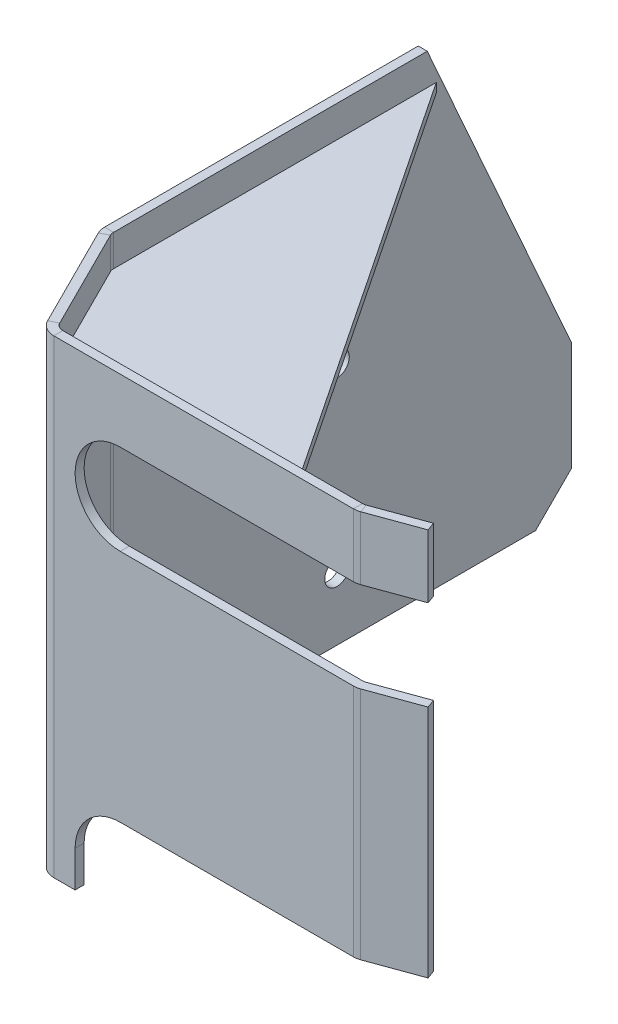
ISO-10303-21;
HEADER;
FILE_DESCRIPTION(('STEP AP214'),'2;1');
FILE_NAME('part.step','',(''),(''),'','','');
FILE_SCHEMA(('AUTOMOTIVE_DESIGN { 1 0 10303 214 1 1 1 1 }'));
ENDSEC;
DATA;
#1=APPLICATION_CONTEXT('core data for automotive mechanical design processes');
#2=APPLICATION_PROTOCOL_DEFINITION('international standard','automotive_design',2000,#1);
#3=PRODUCT_CONTEXT('',#1,'mechanical');
#4=PRODUCT('Part','Part','',(#3));
#5=PRODUCT_RELATED_PRODUCT_CATEGORY('part','',(#4));
#6=PRODUCT_DEFINITION_FORMATION('','',#4);
#7=PRODUCT_DEFINITION_CONTEXT('part definition',#1,'design');
#8=PRODUCT_DEFINITION('design','',#6,#7);
#9=PRODUCT_DEFINITION_SHAPE('','',#8);
#10=(LENGTH_UNIT() NAMED_UNIT(*) SI_UNIT(.MILLI.,.METRE.));
#11=(NAMED_UNIT(*) PLANE_ANGLE_UNIT() SI_UNIT($,.RADIAN.));
#12=(NAMED_UNIT(*) SI_UNIT($,.STERADIAN.) SOLID_ANGLE_UNIT());
#13=UNCERTAINTY_MEASURE_WITH_UNIT(LENGTH_MEASURE(1.E-05),#10,'distance_accuracy_value','');
#14=(GEOMETRIC_REPRESENTATION_CONTEXT(3) GLOBAL_UNCERTAINTY_ASSIGNED_CONTEXT((#13)) GLOBAL_UNIT_ASSIGNED_CONTEXT((#10,
#11,#12)) REPRESENTATION_CONTEXT('',''));
#15=CARTESIAN_POINT('',(0.,0.,0.));
#16=DIRECTION('',(0.,0.,1.));
#17=DIRECTION('',(1.,0.,0.));
#18=AXIS2_PLACEMENT_3D('',#15,#16,#17);
#19=CARTESIAN_POINT('',(15.,130.,157.5));
#20=DIRECTION('',(0.,0.,-1.));
#21=DIRECTION('',(-1.,0.,0.));
#22=AXIS2_PLACEMENT_3D('',#19,#20,#21);
#23=PLANE('',#22);
#24=CARTESIAN_POINT('',(34.9504396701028,10.,157.5));
#25=DIRECTION('',(0.,0.,-1.));
#26=DIRECTION('',(-1.,0.,0.));
#27=AXIS2_PLACEMENT_3D('',#24,#25,#26);
#28=CIRCLE('',#27,12.5);
#29=CARTESIAN_POINT('',(22.4504396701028,10.,157.5));
#30=VERTEX_POINT('',#29);
#31=CARTESIAN_POINT('',(34.9504396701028,22.5,157.5));
#32=VERTEX_POINT('',#31);
#33=EDGE_CURVE('E288',#30,#32,#28,.T.);
#34=ORIENTED_EDGE('',*,*,#33,.F.);
#35=DIRECTION('',(0.,-1.,0.));
#36=VECTOR('',#35,1.);
#37=CARTESIAN_POINT('',(22.4504396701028,10.,157.5));
#38=LINE('',#37,#36);
#39=CARTESIAN_POINT('',(22.4504396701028,0.,157.5));
#40=VERTEX_POINT('',#39);
#41=EDGE_CURVE('E270',#30,#40,#38,.T.);
#42=ORIENTED_EDGE('',*,*,#41,.T.);
#43=DIRECTION('',(1.,0.,0.));
#44=VECTOR('',#43,1.);
#45=CARTESIAN_POINT('',(15.,0.,157.5));
#46=LINE('',#45,#44);
#47=CARTESIAN_POINT('',(16.5450849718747,0.,157.5));
#48=VERTEX_POINT('',#47);
#49=EDGE_CURVE('E285',#48,#40,#46,.T.);
#50=ORIENTED_EDGE('',*,*,#49,.F.);
#51=DIRECTION('',(0.,-1.,0.));
#52=VECTOR('',#51,1.);
#53=CARTESIAN_POINT('',(16.5450849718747,130.,157.5));
#54=LINE('',#53,#52);
#55=CARTESIAN_POINT('',(16.5450849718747,118.75,157.5));
#56=VERTEX_POINT('',#55);
#57=EDGE_CURVE('E440',#56,#48,#54,.T.);
#58=ORIENTED_EDGE('',*,*,#57,.F.);
#59=DIRECTION('',(1.,0.,0.));
#60=VECTOR('',#59,1.);
#61=CARTESIAN_POINT('',(15.,118.75,157.5));
#62=LINE('',#61,#60);
#63=CARTESIAN_POINT('',(80.,118.75,157.5));
#64=VERTEX_POINT('',#63);
#65=EDGE_CURVE('E630',#56,#64,#62,.T.);
#66=ORIENTED_EDGE('',*,*,#65,.T.);
#67=DIRECTION('',(0.,-1.,0.));
#68=VECTOR('',#67,1.);
#69=CARTESIAN_POINT('',(80.,130.,157.5));
#70=LINE('',#69,#68);
#71=CARTESIAN_POINT('',(80.,121.25,157.5));
#72=VERTEX_POINT('',#71);
#73=EDGE_CURVE('E523',#72,#64,#70,.T.);
#74=ORIENTED_EDGE('',*,*,#73,.F.);
#75=DIRECTION('',(1.,0.,0.));
#76=VECTOR('',#75,1.);
#77=CARTESIAN_POINT('',(15.,121.25,157.5));
#78=LINE('',#77,#76);
#79=CARTESIAN_POINT('',(16.5450849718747,121.25,157.5));
#80=VERTEX_POINT('',#79);
#81=EDGE_CURVE('E524',#80,#72,#78,.T.);
#82=ORIENTED_EDGE('',*,*,#81,.F.);
#83=CARTESIAN_POINT('',(16.5450849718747,130.,157.5));
#84=VERTEX_POINT('',#83);
#85=EDGE_CURVE('E441',#84,#80,#54,.T.);
#86=ORIENTED_EDGE('',*,*,#85,.F.);
#87=DIRECTION('',(1.,0.,0.));
#88=VECTOR('',#87,1.);
#89=CARTESIAN_POINT('',(15.,130.,157.5));
#90=LINE('',#89,#88);
#91=CARTESIAN_POINT('',(99.5591825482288,130.,157.5));
#92=VERTEX_POINT('',#91);
#93=EDGE_CURVE('E355',#84,#92,#90,.T.);
#94=ORIENTED_EDGE('',*,*,#93,.T.);
#95=DIRECTION('',(0.,-1.,0.));
#96=VECTOR('',#95,1.);
#97=CARTESIAN_POINT('',(99.5591825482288,130.,157.5));
#98=LINE('',#97,#96);
#99=CARTESIAN_POINT('',(99.5591825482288,112.5,157.5));
#100=VERTEX_POINT('',#99);
#101=EDGE_CURVE('E445',#92,#100,#98,.T.);
#102=ORIENTED_EDGE('',*,*,#101,.T.);
#103=DIRECTION('',(1.,0.,0.));
#104=VECTOR('',#103,1.);
#105=CARTESIAN_POINT('',(114.950439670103,112.5,157.5));
#106=LINE('',#105,#104);
#107=CARTESIAN_POINT('',(34.9504396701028,112.5,157.5));
#108=VERTEX_POINT('',#107);
#109=EDGE_CURVE('E298',#108,#100,#106,.T.);
#110=ORIENTED_EDGE('',*,*,#109,.F.);
#111=CARTESIAN_POINT('',(34.9504396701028,100.,157.5));
#112=DIRECTION('',(0.,0.,-1.));
#113=DIRECTION('',(-1.,0.,0.));
#114=AXIS2_PLACEMENT_3D('',#111,#112,#113);
#115=CIRCLE('',#114,12.5);
#116=CARTESIAN_POINT('',(34.9504396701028,87.5,157.5));
#117=VERTEX_POINT('',#116);
#118=EDGE_CURVE('E646',#117,#108,#115,.T.);
#119=ORIENTED_EDGE('',*,*,#118,.F.);
#120=DIRECTION('',(-1.,0.,0.));
#121=VECTOR('',#120,1.);
#122=CARTESIAN_POINT('',(114.950439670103,87.5,157.5));
#123=LINE('',#122,#121);
#124=CARTESIAN_POINT('',(99.5591825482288,87.5,157.5));
#125=VERTEX_POINT('',#124);
#126=EDGE_CURVE('E649',#125,#117,#123,.T.);
#127=ORIENTED_EDGE('',*,*,#126,.F.);
#128=CARTESIAN_POINT('',(99.5591825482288,22.5,157.5));
#129=VERTEX_POINT('',#128);
#130=EDGE_CURVE('E444',#125,#129,#98,.T.);
#131=ORIENTED_EDGE('',*,*,#130,.T.);
#132=DIRECTION('',(1.,0.,0.));
#133=VECTOR('',#132,1.);
#134=CARTESIAN_POINT('',(114.950439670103,22.5,157.5));
#135=LINE('',#134,#133);
#136=EDGE_CURVE('E538',#32,#129,#135,.T.);
#137=ORIENTED_EDGE('',*,*,#136,.F.);
#138=EDGE_LOOP('',(#34,#42,#50,#58,#66,#74,#82,#86,#94,#102,#110,#119,#127,#131,#137));
#139=FACE_BOUND('',#138,.T.);
#140=ADVANCED_FACE('F42',(#139),#23,.T.);
#141=CARTESIAN_POINT('',(15.,130.,160.));
#142=DIRECTION('',(0.,0.,-1.));
#143=DIRECTION('',(-1.,0.,0.));
#144=AXIS2_PLACEMENT_3D('',#141,#142,#143);
#145=PLANE('',#144);
#146=DIRECTION('',(0.,1.,0.));
#147=VECTOR('',#146,1.);
#148=CARTESIAN_POINT('',(22.4504396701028,130.,160.));
#149=LINE('',#148,#147);
#150=CARTESIAN_POINT('',(22.4504396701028,10.,160.));
#151=VERTEX_POINT('',#150);
#152=CARTESIAN_POINT('',(22.4504396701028,0.,160.));
#153=VERTEX_POINT('',#152);
#154=EDGE_CURVE('E273',#151,#153,#149,.F.);
#155=ORIENTED_EDGE('',*,*,#154,.F.);
#156=CARTESIAN_POINT('',(34.9504396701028,10.,160.));
#157=DIRECTION('',(0.,0.,-1.));
#158=DIRECTION('',(-1.,0.,0.));
#159=AXIS2_PLACEMENT_3D('',#156,#157,#158);
#160=CIRCLE('',#159,12.5);
#161=CARTESIAN_POINT('',(34.9504396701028,22.5,160.));
#162=VERTEX_POINT('',#161);
#163=EDGE_CURVE('E537',#151,#162,#160,.T.);
#164=ORIENTED_EDGE('',*,*,#163,.T.);
#165=DIRECTION('',(1.,0.,0.));
#166=VECTOR('',#165,1.);
#167=CARTESIAN_POINT('',(114.950439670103,22.5,160.));
#168=LINE('',#167,#166);
#169=CARTESIAN_POINT('',(99.5591825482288,22.5,160.));
#170=VERTEX_POINT('',#169);
#171=EDGE_CURVE('E567',#162,#170,#168,.T.);
#172=ORIENTED_EDGE('',*,*,#171,.T.);
#173=DIRECTION('',(0.,-1.,0.));
#174=VECTOR('',#173,1.);
#175=CARTESIAN_POINT('',(99.5591825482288,130.,160.));
#176=LINE('',#175,#174);
#177=CARTESIAN_POINT('',(99.5591825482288,87.5,160.));
#178=VERTEX_POINT('',#177);
#179=EDGE_CURVE('E402',#178,#170,#176,.T.);
#180=ORIENTED_EDGE('',*,*,#179,.F.);
#181=DIRECTION('',(-1.,0.,0.));
#182=VECTOR('',#181,1.);
#183=CARTESIAN_POINT('',(114.950439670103,87.5,160.));
#184=LINE('',#183,#182);
#185=CARTESIAN_POINT('',(34.9504396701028,87.5,160.));
#186=VERTEX_POINT('',#185);
#187=EDGE_CURVE('E665',#178,#186,#184,.T.);
#188=ORIENTED_EDGE('',*,*,#187,.T.);
#189=CARTESIAN_POINT('',(34.9504396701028,100.,160.));
#190=DIRECTION('',(0.,0.,-1.));
#191=DIRECTION('',(-1.,0.,0.));
#192=AXIS2_PLACEMENT_3D('',#189,#190,#191);
#193=CIRCLE('',#192,12.5);
#194=CARTESIAN_POINT('',(34.9504396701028,112.5,160.));
#195=VERTEX_POINT('',#194);
#196=EDGE_CURVE('E535',#186,#195,#193,.T.);
#197=ORIENTED_EDGE('',*,*,#196,.T.);
#198=DIRECTION('',(1.,0.,0.));
#199=VECTOR('',#198,1.);
#200=CARTESIAN_POINT('',(114.950439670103,112.5,160.));
#201=LINE('',#200,#199);
#202=CARTESIAN_POINT('',(99.5591825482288,112.5,160.));
#203=VERTEX_POINT('',#202);
#204=EDGE_CURVE('E532',#195,#203,#201,.T.);
#205=ORIENTED_EDGE('',*,*,#204,.T.);
#206=CARTESIAN_POINT('',(99.5591825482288,130.,160.));
#207=VERTEX_POINT('',#206);
#208=EDGE_CURVE('E403',#207,#203,#176,.T.);
#209=ORIENTED_EDGE('',*,*,#208,.F.);
#210=DIRECTION('',(1.,0.,0.));
#211=VECTOR('',#210,1.);
#212=CARTESIAN_POINT('',(15.,130.,160.));
#213=LINE('',#212,#211);
#214=CARTESIAN_POINT('',(16.5450849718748,130.,160.));
#215=VERTEX_POINT('',#214);
#216=EDGE_CURVE('E389',#215,#207,#213,.T.);
#217=ORIENTED_EDGE('',*,*,#216,.F.);
#218=DIRECTION('',(0.,-1.,0.));
#219=VECTOR('',#218,1.);
#220=CARTESIAN_POINT('',(16.5450849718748,130.,160.));
#221=LINE('',#220,#219);
#222=CARTESIAN_POINT('',(16.5450849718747,0.,160.));
#223=VERTEX_POINT('',#222);
#224=EDGE_CURVE('E407',#215,#223,#221,.T.);
#225=ORIENTED_EDGE('',*,*,#224,.T.);
#226=DIRECTION('',(1.,0.,0.));
#227=VECTOR('',#226,1.);
#228=CARTESIAN_POINT('',(15.,0.,160.));
#229=LINE('',#228,#227);
#230=EDGE_CURVE('E337',#223,#153,#229,.T.);
#231=ORIENTED_EDGE('',*,*,#230,.T.);
#232=EDGE_LOOP('',(#155,#164,#172,#180,#188,#197,#205,#209,#217,#225,#231));
#233=FACE_BOUND('',#232,.T.);
#234=ADVANCED_FACE('F752',(#233),#145,.F.);
#235=CARTESIAN_POINT('',(101.269283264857,0.,159.69846310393));
#236=DIRECTION('',(0.,-1.,0.));
#237=DIRECTION('',(0.,0.,-1.));
#238=AXIS2_PLACEMENT_3D('',#235,#236,#237);
#239=PLANE('',#238);
#240=ORIENTED_EDGE('',*,*,#49,.T.);
#241=DIRECTION('',(0.,0.,-1.));
#242=VECTOR('',#241,1.);
#243=CARTESIAN_POINT('',(22.4504396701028,0.,157.5));
#244=LINE('',#243,#242);
#245=EDGE_CURVE('E267',#40,#153,#244,.F.);
#246=ORIENTED_EDGE('',*,*,#245,.T.);
#247=ORIENTED_EDGE('',*,*,#230,.F.);
#248=DIRECTION('',(0.,0.,-1.));
#249=VECTOR('',#248,1.);
#250=CARTESIAN_POINT('',(16.5450849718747,0.,160.));
#251=LINE('',#250,#249);
#252=EDGE_CURVE('E295',#223,#48,#251,.T.);
#253=ORIENTED_EDGE('',*,*,#252,.T.);
#254=EDGE_LOOP('',(#240,#246,#247,#253));
#255=FACE_BOUND('',#254,.T.);
#256=ADVANCED_FACE('F293',(#255),#239,.T.);
#257=CARTESIAN_POINT('',(100.855050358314,130.,159.849231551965));
#258=DIRECTION('',(-0.34202014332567,0.,-0.939692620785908));
#259=DIRECTION('',(-0.939692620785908,0.,0.34202014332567));
#260=AXIS2_PLACEMENT_3D('',#257,#258,#259);
#261=PLANE('',#260);
#262=DIRECTION('',(0.939692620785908,0.,-0.34202014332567));
#263=VECTOR('',#262,1.);
#264=CARTESIAN_POINT('',(164.676466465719,22.5,136.620135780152));
#265=LINE('',#264,#263);
#266=CARTESIAN_POINT('',(101.269283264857,22.5,159.69846310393));
#267=VERTEX_POINT('',#266);
#268=CARTESIAN_POINT('',(114.950439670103,22.5,154.71892940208));
#269=VERTEX_POINT('',#268);
#270=EDGE_CURVE('E601',#267,#269,#265,.T.);
#271=ORIENTED_EDGE('',*,*,#270,.T.);
#272=DIRECTION('',(0.,-1.,0.));
#273=VECTOR('',#272,1.);
#274=CARTESIAN_POINT('',(114.950439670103,130.,154.71892940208));
#275=LINE('',#274,#273);
#276=CARTESIAN_POINT('',(114.950439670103,87.5,154.71892940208));
#277=VERTEX_POINT('',#276);
#278=EDGE_CURVE('E459',#277,#269,#275,.T.);
#279=ORIENTED_EDGE('',*,*,#278,.F.);
#280=DIRECTION('',(-0.939692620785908,0.,0.34202014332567));
#281=VECTOR('',#280,1.);
#282=CARTESIAN_POINT('',(164.676466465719,87.5,136.620135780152));
#283=LINE('',#282,#281);
#284=CARTESIAN_POINT('',(101.269283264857,87.5,159.69846310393));
#285=VERTEX_POINT('',#284);
#286=EDGE_CURVE('E661',#277,#285,#283,.T.);
#287=ORIENTED_EDGE('',*,*,#286,.T.);
#288=DIRECTION('',(0.,-1.,0.));
#289=VECTOR('',#288,1.);
#290=CARTESIAN_POINT('',(101.269283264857,130.,159.69846310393));
#291=LINE('',#290,#289);
#292=EDGE_CURVE('E397',#285,#267,#291,.T.);
#293=ORIENTED_EDGE('',*,*,#292,.T.);
#294=EDGE_LOOP('',(#271,#279,#287,#293));
#295=FACE_BOUND('',#294,.T.);
#296=ADVANCED_FACE('F782',(#295),#261,.F.);
#297=CARTESIAN_POINT('',(114.095389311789,130.,152.369697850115));
#298=DIRECTION('',(0.939692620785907,0.,-0.342020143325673));
#299=DIRECTION('',(-0.342020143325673,0.,-0.939692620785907));
#300=AXIS2_PLACEMENT_3D('',#297,#298,#299);
#301=PLANE('',#300);
#302=ORIENTED_EDGE('',*,*,#278,.T.);
#303=DIRECTION('',(0.342020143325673,0.,0.939692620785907));
#304=VECTOR('',#303,1.);
#305=CARTESIAN_POINT('',(65.2244128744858,22.5,18.0977936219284));
#306=LINE('',#305,#304);
#307=CARTESIAN_POINT('',(114.095389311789,22.5,152.369697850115));
#308=VERTEX_POINT('',#307);
#309=EDGE_CURVE('E598',#308,#269,#306,.T.);
#310=ORIENTED_EDGE('',*,*,#309,.F.);
#311=DIRECTION('',(0.,-1.,0.));
#312=VECTOR('',#311,1.);
#313=CARTESIAN_POINT('',(114.095389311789,130.,152.369697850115));
#314=LINE('',#313,#312);
#315=CARTESIAN_POINT('',(114.095389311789,87.5,152.369697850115));
#316=VERTEX_POINT('',#315);
#317=EDGE_CURVE('E454',#316,#308,#314,.T.);
#318=ORIENTED_EDGE('',*,*,#317,.F.);
#319=DIRECTION('',(-0.342020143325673,0.,-0.939692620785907));
#320=VECTOR('',#319,1.);
#321=CARTESIAN_POINT('',(65.2244128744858,87.5,18.0977936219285));
#322=LINE('',#321,#320);
#323=EDGE_CURVE('E658',#277,#316,#322,.T.);
#324=ORIENTED_EDGE('',*,*,#323,.F.);
#325=EDGE_LOOP('',(#302,#310,#318,#324));
#326=FACE_BOUND('',#325,.T.);
#327=ADVANCED_FACE('F861',(#326),#301,.T.);
#328=CARTESIAN_POINT('',(100.,130.,157.5));
#329=DIRECTION('',(-0.34202014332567,0.,-0.939692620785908));
#330=DIRECTION('',(-0.939692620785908,0.,0.34202014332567));
#331=AXIS2_PLACEMENT_3D('',#328,#329,#330);
#332=PLANE('',#331);
#333=ORIENTED_EDGE('',*,*,#317,.T.);
#334=DIRECTION('',(0.939692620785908,0.,-0.34202014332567));
#335=VECTOR('',#334,1.);
#336=CARTESIAN_POINT('',(163.821416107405,22.5,134.270904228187));
#337=LINE('',#336,#335);
#338=CARTESIAN_POINT('',(100.414232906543,22.5,157.349231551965));
#339=VERTEX_POINT('',#338);
#340=EDGE_CURVE('E555',#339,#308,#337,.T.);
#341=ORIENTED_EDGE('',*,*,#340,.F.);
#342=DIRECTION('',(0.,-1.,0.));
#343=VECTOR('',#342,1.);
#344=CARTESIAN_POINT('',(100.414232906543,130.,157.349231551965));
#345=LINE('',#344,#343);
#346=CARTESIAN_POINT('',(100.414232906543,87.5,157.349231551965));
#347=VERTEX_POINT('',#346);
#348=EDGE_CURVE('E449',#347,#339,#345,.T.);
#349=ORIENTED_EDGE('',*,*,#348,.F.);
#350=DIRECTION('',(-0.939692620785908,0.,0.34202014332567));
#351=VECTOR('',#350,1.);
#352=CARTESIAN_POINT('',(163.821416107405,87.5,134.270904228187));
#353=LINE('',#352,#351);
#354=EDGE_CURVE('E655',#316,#347,#353,.T.);
#355=ORIENTED_EDGE('',*,*,#354,.F.);
#356=EDGE_LOOP('',(#333,#341,#349,#355));
#357=FACE_BOUND('',#356,.T.);
#358=ADVANCED_FACE('F797',(#357),#332,.T.);
#359=CARTESIAN_POINT('',(99.5591825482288,130.,155.));
#360=DIRECTION('',(0.,-1.,0.));
#361=DIRECTION('',(0.,0.,-1.));
#362=AXIS2_PLACEMENT_3D('',#359,#360,#361);
#363=CYLINDRICAL_SURFACE('',#362,2.5);
#364=ORIENTED_EDGE('',*,*,#348,.T.);
#365=CARTESIAN_POINT('',(99.5591825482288,22.5,155.));
#366=DIRECTION('',(0.,-1.,0.));
#367=DIRECTION('',(0.,0.,-1.));
#368=AXIS2_PLACEMENT_3D('',#365,#366,#367);
#369=CIRCLE('',#368,2.5);
#370=EDGE_CURVE('E553',#129,#339,#369,.F.);
#371=ORIENTED_EDGE('',*,*,#370,.F.);
#372=ORIENTED_EDGE('',*,*,#130,.F.);
#373=CARTESIAN_POINT('',(99.5591825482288,87.5,155.));
#374=DIRECTION('',(0.,1.,0.));
#375=DIRECTION('',(0.,0.,1.));
#376=AXIS2_PLACEMENT_3D('',#373,#374,#375);
#377=CIRCLE('',#376,2.5);
#378=EDGE_CURVE('E652',#347,#125,#377,.F.);
#379=ORIENTED_EDGE('',*,*,#378,.F.);
#380=EDGE_LOOP('',(#364,#371,#372,#379));
#381=FACE_BOUND('',#380,.T.);
#382=ADVANCED_FACE('F775',(#381),#363,.F.);
#383=CARTESIAN_POINT('',(99.5591825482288,130.,155.));
#384=DIRECTION('',(0.,-1.,0.));
#385=DIRECTION('',(0.,0.,-1.));
#386=AXIS2_PLACEMENT_3D('',#383,#384,#385);
#387=CYLINDRICAL_SURFACE('',#386,5.);
#388=CARTESIAN_POINT('',(99.5591825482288,22.5,155.));
#389=DIRECTION('',(0.,-1.,0.));
#390=DIRECTION('',(0.,0.,-1.));
#391=AXIS2_PLACEMENT_3D('',#388,#389,#390);
#392=CIRCLE('',#391,5.);
#393=EDGE_CURVE('E570',#170,#267,#392,.F.);
#394=ORIENTED_EDGE('',*,*,#393,.T.);
#395=ORIENTED_EDGE('',*,*,#292,.F.);
#396=CARTESIAN_POINT('',(99.5591825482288,87.5,155.));
#397=DIRECTION('',(0.,1.,0.));
#398=DIRECTION('',(0.,0.,1.));
#399=AXIS2_PLACEMENT_3D('',#396,#397,#398);
#400=CIRCLE('',#399,5.);
#401=EDGE_CURVE('E529',#285,#178,#400,.F.);
#402=ORIENTED_EDGE('',*,*,#401,.T.);
#403=ORIENTED_EDGE('',*,*,#179,.T.);
#404=EDGE_LOOP('',(#394,#395,#402,#403));
#405=FACE_BOUND('',#404,.T.);
#406=ADVANCED_FACE('F785',(#405),#387,.T.);
#407=CARTESIAN_POINT('',(16.5450849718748,130.,155.));
#408=DIRECTION('',(0.,-1.,0.));
#409=DIRECTION('',(0.,0.,-1.));
#410=AXIS2_PLACEMENT_3D('',#407,#408,#409);
#411=CYLINDRICAL_SURFACE('',#410,2.5);
#412=DIRECTION('',(0.,-1.,0.));
#413=VECTOR('',#412,1.);
#414=CARTESIAN_POINT('',(14.309016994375,130.,156.11803398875));
#415=LINE('',#414,#413);
#416=CARTESIAN_POINT('',(14.309016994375,118.75,156.11803398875));
#417=VERTEX_POINT('',#416);
#418=CARTESIAN_POINT('',(14.309016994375,0.,156.11803398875));
#419=VERTEX_POINT('',#418);
#420=EDGE_CURVE('E435',#417,#419,#415,.T.);
#421=ORIENTED_EDGE('',*,*,#420,.F.);
#422=CARTESIAN_POINT('',(16.5450849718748,118.75,155.));
#423=DIRECTION('',(0.,1.,0.));
#424=DIRECTION('',(0.,0.,1.));
#425=AXIS2_PLACEMENT_3D('',#422,#423,#424);
#426=CIRCLE('',#425,2.5);
#427=EDGE_CURVE('E626',#417,#56,#426,.T.);
#428=ORIENTED_EDGE('',*,*,#427,.T.);
#429=ORIENTED_EDGE('',*,*,#57,.T.);
#430=CARTESIAN_POINT('',(16.5450849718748,0.,155.));
#431=DIRECTION('',(0.,-1.,0.));
#432=DIRECTION('',(0.,0.,-1.));
#433=AXIS2_PLACEMENT_3D('',#430,#431,#432);
#434=CIRCLE('',#433,2.5);
#435=EDGE_CURVE('E297',#419,#48,#434,.F.);
#436=ORIENTED_EDGE('',*,*,#435,.F.);
#437=EDGE_LOOP('',(#421,#428,#429,#436));
#438=FACE_BOUND('',#437,.T.);
#439=ADVANCED_FACE('F836',(#438),#411,.F.);
#440=CARTESIAN_POINT('',(15.,130.,157.5));
#441=DIRECTION('',(0.894427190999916,0.,-0.447213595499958));
#442=DIRECTION('',(-0.447213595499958,0.,-0.894427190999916));
#443=AXIS2_PLACEMENT_3D('',#440,#441,#442);
#444=PLANE('',#443);
#445=DIRECTION('',(0.,-1.,0.));
#446=VECTOR('',#445,1.);
#447=CARTESIAN_POINT('',(0.263932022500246,130.,128.027864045));
#448=LINE('',#447,#446);
#449=CARTESIAN_POINT('',(0.263932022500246,118.75,128.027864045));
#450=VERTEX_POINT('',#449);
#451=CARTESIAN_POINT('',(0.263932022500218,0.,128.027864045));
#452=VERTEX_POINT('',#451);
#453=EDGE_CURVE('E430',#450,#452,#448,.T.);
#454=ORIENTED_EDGE('',*,*,#453,.F.);
#455=DIRECTION('',(0.447213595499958,0.,0.894427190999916));
#456=VECTOR('',#455,1.);
#457=CARTESIAN_POINT('',(15.,118.75,157.5));
#458=LINE('',#457,#456);
#459=EDGE_CURVE('E622',#450,#417,#458,.T.);
#460=ORIENTED_EDGE('',*,*,#459,.T.);
#461=ORIENTED_EDGE('',*,*,#420,.T.);
#462=DIRECTION('',(0.447213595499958,0.,0.894427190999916));
#463=VECTOR('',#462,1.);
#464=CARTESIAN_POINT('',(15.,0.,157.5));
#465=LINE('',#464,#463);
#466=EDGE_CURVE('E303',#452,#419,#465,.T.);
#467=ORIENTED_EDGE('',*,*,#466,.F.);
#468=EDGE_LOOP('',(#454,#460,#461,#467));
#469=FACE_BOUND('',#468,.T.);
#470=ADVANCED_FACE('F814',(#469),#444,.T.);
#471=CARTESIAN_POINT('',(2.50000000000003,130.,126.909830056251));
#472=DIRECTION('',(0.,-1.,0.));
#473=DIRECTION('',(0.,0.,-1.));
#474=AXIS2_PLACEMENT_3D('',#471,#472,#473);
#475=CYLINDRICAL_SURFACE('',#474,2.5);
#476=DIRECTION('',(0.,-1.,0.));
#477=VECTOR('',#476,1.);
#478=CARTESIAN_POINT('',(0.,130.,126.90983005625));
#479=LINE('',#478,#477);
#480=CARTESIAN_POINT('',(0.,118.75,126.90983005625));
#481=VERTEX_POINT('',#480);
#482=CARTESIAN_POINT('',(0.,0.,126.909830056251));
#483=VERTEX_POINT('',#482);
#484=EDGE_CURVE('E425',#481,#483,#479,.T.);
#485=ORIENTED_EDGE('',*,*,#484,.F.);
#486=CARTESIAN_POINT('',(2.5,118.75,126.909830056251));
#487=DIRECTION('',(0.,1.,0.));
#488=DIRECTION('',(0.,0.,1.));
#489=AXIS2_PLACEMENT_3D('',#486,#487,#488);
#490=CIRCLE('',#489,2.5);
#491=EDGE_CURVE('E618',#481,#450,#490,.T.);
#492=ORIENTED_EDGE('',*,*,#491,.T.);
#493=ORIENTED_EDGE('',*,*,#453,.T.);
#494=CARTESIAN_POINT('',(2.5,0.,126.909830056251));
#495=DIRECTION('',(0.,-1.,0.));
#496=DIRECTION('',(0.,0.,-1.));
#497=AXIS2_PLACEMENT_3D('',#494,#495,#496);
#498=CIRCLE('',#497,2.5);
#499=EDGE_CURVE('E313',#483,#452,#498,.F.);
#500=ORIENTED_EDGE('',*,*,#499,.F.);
#501=EDGE_LOOP('',(#485,#492,#493,#500));
#502=FACE_BOUND('',#501,.T.);
#503=ADVANCED_FACE('F808',(#502),#475,.F.);
#504=DIRECTION('',(0.939692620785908,0.,-0.34202014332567));
#505=VECTOR('',#504,1.);
#506=CARTESIAN_POINT('',(164.676466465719,112.5,136.620135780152));
#507=LINE('',#506,#505);
#508=CARTESIAN_POINT('',(101.269283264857,112.5,159.69846310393));
#509=VERTEX_POINT('',#508);
#510=CARTESIAN_POINT('',(114.950439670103,112.5,154.71892940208));
#511=VERTEX_POINT('',#510);
#512=EDGE_CURVE('E676',#509,#511,#507,.T.);
#513=ORIENTED_EDGE('',*,*,#512,.T.);
#514=CARTESIAN_POINT('',(114.950439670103,130.,154.71892940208));
#515=VERTEX_POINT('',#514);
#516=EDGE_CURVE('E460',#515,#511,#275,.T.);
#517=ORIENTED_EDGE('',*,*,#516,.F.);
#518=DIRECTION('',(0.939692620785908,0.,-0.34202014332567));
#519=VECTOR('',#518,1.);
#520=CARTESIAN_POINT('',(100.855050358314,130.,159.849231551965));
#521=LINE('',#520,#519);
#522=CARTESIAN_POINT('',(101.269283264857,130.,159.69846310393));
#523=VERTEX_POINT('',#522);
#524=EDGE_CURVE('E340',#523,#515,#521,.T.);
#525=ORIENTED_EDGE('',*,*,#524,.F.);
#526=EDGE_CURVE('E398',#523,#509,#291,.T.);
#527=ORIENTED_EDGE('',*,*,#526,.T.);
#528=EDGE_LOOP('',(#513,#517,#525,#527));
#529=FACE_BOUND('',#528,.T.);
#530=ADVANCED_FACE('F760',(#529),#261,.F.);
#531=ORIENTED_EDGE('',*,*,#516,.T.);
#532=DIRECTION('',(0.342020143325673,0.,0.939692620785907));
#533=VECTOR('',#532,1.);
#534=CARTESIAN_POINT('',(65.2244128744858,112.5,18.0977936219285));
#535=LINE('',#534,#533);
#536=CARTESIAN_POINT('',(114.095389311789,112.5,152.369697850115));
#537=VERTEX_POINT('',#536);
#538=EDGE_CURVE('E680',#537,#511,#535,.T.);
#539=ORIENTED_EDGE('',*,*,#538,.F.);
#540=CARTESIAN_POINT('',(114.095389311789,130.,152.369697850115));
#541=VERTEX_POINT('',#540);
#542=EDGE_CURVE('E455',#541,#537,#314,.T.);
#543=ORIENTED_EDGE('',*,*,#542,.F.);
#544=DIRECTION('',(0.342020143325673,0.,0.939692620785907));
#545=VECTOR('',#544,1.);
#546=CARTESIAN_POINT('',(114.095389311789,130.,152.369697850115));
#547=LINE('',#546,#545);
#548=EDGE_CURVE('E343',#541,#515,#547,.T.);
#549=ORIENTED_EDGE('',*,*,#548,.T.);
#550=EDGE_LOOP('',(#531,#539,#543,#549));
#551=FACE_BOUND('',#550,.T.);
#552=ADVANCED_FACE('F692',(#551),#301,.T.);
#553=ORIENTED_EDGE('',*,*,#542,.T.);
#554=DIRECTION('',(0.939692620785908,0.,-0.34202014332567));
#555=VECTOR('',#554,1.);
#556=CARTESIAN_POINT('',(163.821416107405,112.5,134.270904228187));
#557=LINE('',#556,#555);
#558=CARTESIAN_POINT('',(100.414232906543,112.5,157.349231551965));
#559=VERTEX_POINT('',#558);
#560=EDGE_CURVE('E563',#559,#537,#557,.T.);
#561=ORIENTED_EDGE('',*,*,#560,.F.);
#562=CARTESIAN_POINT('',(100.414232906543,130.,157.349231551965));
#563=VERTEX_POINT('',#562);
#564=EDGE_CURVE('E450',#563,#559,#345,.T.);
#565=ORIENTED_EDGE('',*,*,#564,.F.);
#566=DIRECTION('',(0.939692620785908,0.,-0.34202014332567));
#567=VECTOR('',#566,1.);
#568=CARTESIAN_POINT('',(100.,130.,157.5));
#569=LINE('',#568,#567);
#570=EDGE_CURVE('E347',#563,#541,#569,.T.);
#571=ORIENTED_EDGE('',*,*,#570,.T.);
#572=EDGE_LOOP('',(#553,#561,#565,#571));
#573=FACE_BOUND('',#572,.T.);
#574=ADVANCED_FACE('F695',(#573),#332,.T.);
#575=ORIENTED_EDGE('',*,*,#564,.T.);
#576=CARTESIAN_POINT('',(99.5591825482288,112.5,155.));
#577=DIRECTION('',(0.,-1.,0.));
#578=DIRECTION('',(0.,0.,-1.));
#579=AXIS2_PLACEMENT_3D('',#576,#577,#578);
#580=CIRCLE('',#579,2.5);
#581=EDGE_CURVE('E306',#100,#559,#580,.F.);
#582=ORIENTED_EDGE('',*,*,#581,.F.);
#583=ORIENTED_EDGE('',*,*,#101,.F.);
#584=CARTESIAN_POINT('',(99.5591825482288,130.,155.));
#585=DIRECTION('',(0.,-1.,0.));
#586=DIRECTION('',(0.,0.,-1.));
#587=AXIS2_PLACEMENT_3D('',#584,#585,#586);
#588=CIRCLE('',#587,2.5);
#589=EDGE_CURVE('E351',#92,#563,#588,.F.);
#590=ORIENTED_EDGE('',*,*,#589,.T.);
#591=EDGE_LOOP('',(#575,#582,#583,#590));
#592=FACE_BOUND('',#591,.T.);
#593=ADVANCED_FACE('F702',(#592),#363,.F.);
#594=CARTESIAN_POINT('',(99.5591825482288,112.5,155.));
#595=DIRECTION('',(0.,-1.,0.));
#596=DIRECTION('',(0.,0.,-1.));
#597=AXIS2_PLACEMENT_3D('',#594,#595,#596);
#598=CIRCLE('',#597,5.);
#599=EDGE_CURVE('E527',#203,#509,#598,.F.);
#600=ORIENTED_EDGE('',*,*,#599,.T.);
#601=ORIENTED_EDGE('',*,*,#526,.F.);
#602=CARTESIAN_POINT('',(99.5591825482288,130.,155.));
#603=DIRECTION('',(0.,1.,0.));
#604=DIRECTION('',(1.,0.,0.));
#605=AXIS2_PLACEMENT_3D('',#602,#603,#604);
#606=CIRCLE('',#605,5.);
#607=EDGE_CURVE('E393',#207,#523,#606,.T.);
#608=ORIENTED_EDGE('',*,*,#607,.F.);
#609=ORIENTED_EDGE('',*,*,#208,.T.);
#610=EDGE_LOOP('',(#600,#601,#608,#609));
#611=FACE_BOUND('',#610,.T.);
#612=ADVANCED_FACE('F757',(#611),#387,.T.);
#613=CARTESIAN_POINT('',(0.263932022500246,130.,128.027864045));
#614=DIRECTION('',(0.,1.,0.));
#615=DIRECTION('',(0.,0.,1.));
#616=AXIS2_PLACEMENT_3D('',#613,#614,#615);
#617=PLANE('',#616);
#618=DIRECTION('',(-0.894427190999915,0.,0.447213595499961));
#619=VECTOR('',#618,1.);
#620=CARTESIAN_POINT('',(0.263932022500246,130.,128.027864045));
#621=LINE('',#620,#619);
#622=CARTESIAN_POINT('',(0.263932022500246,130.,128.027864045));
#623=VERTEX_POINT('',#622);
#624=CARTESIAN_POINT('',(-1.97213595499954,130.,129.14589803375));
#625=VERTEX_POINT('',#624);
#626=EDGE_CURVE('E494',#623,#625,#621,.T.);
#627=ORIENTED_EDGE('',*,*,#626,.F.);
#628=CARTESIAN_POINT('',(2.50000000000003,130.,126.909830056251));
#629=DIRECTION('',(0.,-1.,0.));
#630=DIRECTION('',(0.,0.,-1.));
#631=AXIS2_PLACEMENT_3D('',#628,#629,#630);
#632=CIRCLE('',#631,2.5);
#633=CARTESIAN_POINT('',(0.,130.,126.90983005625));
#634=VERTEX_POINT('',#633);
#635=EDGE_CURVE('E367',#634,#623,#632,.F.);
#636=ORIENTED_EDGE('',*,*,#635,.F.);
#637=DIRECTION('',(1.,0.,0.));
#638=VECTOR('',#637,1.);
#639=CARTESIAN_POINT('',(-2.49999999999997,130.,126.90983005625));
#640=LINE('',#639,#638);
#641=CARTESIAN_POINT('',(-2.49999999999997,130.,126.90983005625));
#642=VERTEX_POINT('',#641);
#643=EDGE_CURVE('E490',#642,#634,#640,.T.);
#644=ORIENTED_EDGE('',*,*,#643,.F.);
#645=CARTESIAN_POINT('',(2.50000000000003,130.,126.909830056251));
#646=DIRECTION('',(0.,1.,0.));
#647=DIRECTION('',(1.,0.,0.));
#648=AXIS2_PLACEMENT_3D('',#645,#646,#647);
#649=CIRCLE('',#648,5.);
#650=EDGE_CURVE('E377',#642,#625,#649,.T.);
#651=ORIENTED_EDGE('',*,*,#650,.T.);
#652=EDGE_LOOP('',(#627,#636,#644,#651));
#653=FACE_BOUND('',#652,.T.);
#654=ADVANCED_FACE('F44',(#653),#617,.T.);
#655=CARTESIAN_POINT('',(-2.49999999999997,130.,126.90983005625));
#656=DIRECTION('',(0.,1.,0.));
#657=DIRECTION('',(0.,0.,1.));
#658=AXIS2_PLACEMENT_3D('',#655,#656,#657);
#659=PLANE('',#658);
#660=DIRECTION('',(0.447213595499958,0.,0.894427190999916));
#661=VECTOR('',#660,1.);
#662=CARTESIAN_POINT('',(15.,130.,157.5));
#663=LINE('',#662,#661);
#664=CARTESIAN_POINT('',(14.309016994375,130.,156.11803398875));
#665=VERTEX_POINT('',#664);
#666=EDGE_CURVE('E363',#623,#665,#663,.T.);
#667=ORIENTED_EDGE('',*,*,#666,.F.);
#668=ORIENTED_EDGE('',*,*,#626,.T.);
#669=DIRECTION('',(0.447213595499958,0.,0.894427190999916));
#670=VECTOR('',#669,1.);
#671=CARTESIAN_POINT('',(12.7639320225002,130.,158.61803398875));
#672=LINE('',#671,#670);
#673=CARTESIAN_POINT('',(12.0729490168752,130.,157.2360679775));
#674=VERTEX_POINT('',#673);
#675=EDGE_CURVE('E381',#625,#674,#672,.T.);
#676=ORIENTED_EDGE('',*,*,#675,.T.);
#677=DIRECTION('',(0.894427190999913,0.,-0.447213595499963));
#678=VECTOR('',#677,1.);
#679=CARTESIAN_POINT('',(12.0729490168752,130.,157.2360679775));
#680=LINE('',#679,#678);
#681=EDGE_CURVE('E476',#674,#665,#680,.T.);
#682=ORIENTED_EDGE('',*,*,#681,.T.);
#683=EDGE_LOOP('',(#667,#668,#676,#682));
#684=FACE_BOUND('',#683,.T.);
#685=ADVANCED_FACE('F724',(#684),#659,.T.);
#686=CARTESIAN_POINT('',(0.,0.,126.909830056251));
#687=DIRECTION('',(0.,-1.,0.));
#688=DIRECTION('',(0.,0.,-1.));
#689=AXIS2_PLACEMENT_3D('',#686,#687,#688);
#690=PLANE('',#689);
#691=DIRECTION('',(-1.,0.,0.));
#692=VECTOR('',#691,1.);
#693=CARTESIAN_POINT('',(0.,0.,126.909830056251));
#694=LINE('',#693,#692);
#695=CARTESIAN_POINT('',(-2.5,0.,126.909830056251));
#696=VERTEX_POINT('',#695);
#697=EDGE_CURVE('E486',#483,#696,#694,.T.);
#698=ORIENTED_EDGE('',*,*,#697,.F.);
#699=ORIENTED_EDGE('',*,*,#499,.T.);
#700=DIRECTION('',(0.894427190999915,0.,-0.447213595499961));
#701=VECTOR('',#700,1.);
#702=CARTESIAN_POINT('',(-1.97213595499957,0.,129.14589803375));
#703=LINE('',#702,#701);
#704=CARTESIAN_POINT('',(-1.97213595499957,0.,129.14589803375));
#705=VERTEX_POINT('',#704);
#706=EDGE_CURVE('E482',#705,#452,#703,.T.);
#707=ORIENTED_EDGE('',*,*,#706,.F.);
#708=CARTESIAN_POINT('',(2.5,0.,126.909830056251));
#709=DIRECTION('',(0.,1.,0.));
#710=DIRECTION('',(1.,0.,0.));
#711=AXIS2_PLACEMENT_3D('',#708,#709,#710);
#712=CIRCLE('',#711,5.);
#713=EDGE_CURVE('E325',#696,#705,#712,.T.);
#714=ORIENTED_EDGE('',*,*,#713,.F.);
#715=EDGE_LOOP('',(#698,#699,#707,#714));
#716=FACE_BOUND('',#715,.T.);
#717=ADVANCED_FACE('F818',(#716),#690,.T.);
#718=CARTESIAN_POINT('',(-1.97213595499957,0.,129.14589803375));
#719=DIRECTION('',(0.,-1.,0.));
#720=DIRECTION('',(0.,0.,-1.));
#721=AXIS2_PLACEMENT_3D('',#718,#719,#720);
#722=PLANE('',#721);
#723=DIRECTION('',(0.,0.,-1.));
#724=VECTOR('',#723,1.);
#725=CARTESIAN_POINT('',(-2.5,0.,127.5));
#726=LINE('',#725,#724);
#727=CARTESIAN_POINT('',(-2.5,0.,10.));
#728=VERTEX_POINT('',#727);
#729=EDGE_CURVE('E321',#728,#696,#726,.F.);
#730=ORIENTED_EDGE('',*,*,#729,.F.);
#731=DIRECTION('',(1.,0.,0.));
#732=VECTOR('',#731,1.);
#733=CARTESIAN_POINT('',(-1.97213595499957,0.,10.));
#734=LINE('',#733,#732);
#735=CARTESIAN_POINT('',(0.,0.,10.0000000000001));
#736=VERTEX_POINT('',#735);
#737=EDGE_CURVE('E497',#728,#736,#734,.T.);
#738=ORIENTED_EDGE('',*,*,#737,.T.);
#739=DIRECTION('',(0.,0.,1.));
#740=VECTOR('',#739,1.);
#741=CARTESIAN_POINT('',(0.,0.,127.5));
#742=LINE('',#741,#740);
#743=EDGE_CURVE('E317',#736,#483,#742,.T.);
#744=ORIENTED_EDGE('',*,*,#743,.T.);
#745=ORIENTED_EDGE('',*,*,#697,.T.);
#746=EDGE_LOOP('',(#730,#738,#744,#745));
#747=FACE_BOUND('',#746,.T.);
#748=ADVANCED_FACE('F821',(#747),#722,.T.);
#749=CARTESIAN_POINT('',(16.5450849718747,130.,157.5));
#750=DIRECTION('',(0.,1.,0.));
#751=DIRECTION('',(0.,0.,1.));
#752=AXIS2_PLACEMENT_3D('',#749,#750,#751);
#753=PLANE('',#752);
#754=DIRECTION('',(0.,0.,1.));
#755=VECTOR('',#754,1.);
#756=CARTESIAN_POINT('',(16.5450849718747,130.,157.5));
#757=LINE('',#756,#755);
#758=EDGE_CURVE('E479',#84,#215,#757,.T.);
#759=ORIENTED_EDGE('',*,*,#758,.F.);
#760=CARTESIAN_POINT('',(16.5450849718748,130.,155.));
#761=DIRECTION('',(0.,-1.,0.));
#762=DIRECTION('',(0.,0.,-1.));
#763=AXIS2_PLACEMENT_3D('',#760,#761,#762);
#764=CIRCLE('',#763,2.5);
#765=EDGE_CURVE('E359',#665,#84,#764,.F.);
#766=ORIENTED_EDGE('',*,*,#765,.F.);
#767=ORIENTED_EDGE('',*,*,#681,.F.);
#768=CARTESIAN_POINT('',(16.5450849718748,130.,155.));
#769=DIRECTION('',(0.,1.,0.));
#770=DIRECTION('',(1.,0.,0.));
#771=AXIS2_PLACEMENT_3D('',#768,#769,#770);
#772=CIRCLE('',#771,5.);
#773=EDGE_CURVE('E385',#674,#215,#772,.T.);
#774=ORIENTED_EDGE('',*,*,#773,.T.);
#775=EDGE_LOOP('',(#759,#766,#767,#774));
#776=FACE_BOUND('',#775,.T.);
#777=ADVANCED_FACE('F717',(#776),#753,.T.);
#778=CARTESIAN_POINT('',(12.0729490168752,130.,157.2360679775));
#779=DIRECTION('',(0.,1.,0.));
#780=DIRECTION('',(0.,0.,1.));
#781=AXIS2_PLACEMENT_3D('',#778,#779,#780);
#782=PLANE('',#781);
#783=ORIENTED_EDGE('',*,*,#93,.F.);
#784=ORIENTED_EDGE('',*,*,#758,.T.);
#785=ORIENTED_EDGE('',*,*,#216,.T.);
#786=DIRECTION('',(0.,0.,-1.));
#787=VECTOR('',#786,1.);
#788=CARTESIAN_POINT('',(99.5591825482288,130.,160.));
#789=LINE('',#788,#787);
#790=EDGE_CURVE('E464',#207,#92,#789,.T.);
#791=ORIENTED_EDGE('',*,*,#790,.T.);
#792=EDGE_LOOP('',(#783,#784,#785,#791));
#793=FACE_BOUND('',#792,.T.);
#794=ADVANCED_FACE('F710',(#793),#782,.T.);
#795=CARTESIAN_POINT('',(14.309016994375,0.,156.11803398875));
#796=DIRECTION('',(0.,-1.,0.));
#797=DIRECTION('',(0.,0.,-1.));
#798=AXIS2_PLACEMENT_3D('',#795,#796,#797);
#799=PLANE('',#798);
#800=DIRECTION('',(-0.894427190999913,0.,0.447213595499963));
#801=VECTOR('',#800,1.);
#802=CARTESIAN_POINT('',(14.309016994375,0.,156.11803398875));
#803=LINE('',#802,#801);
#804=CARTESIAN_POINT('',(12.0729490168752,0.,157.2360679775));
#805=VERTEX_POINT('',#804);
#806=EDGE_CURVE('E472',#419,#805,#803,.T.);
#807=ORIENTED_EDGE('',*,*,#806,.F.);
#808=ORIENTED_EDGE('',*,*,#435,.T.);
#809=ORIENTED_EDGE('',*,*,#252,.F.);
#810=CARTESIAN_POINT('',(16.5450849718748,0.,155.));
#811=DIRECTION('',(0.,1.,0.));
#812=DIRECTION('',(1.,0.,0.));
#813=AXIS2_PLACEMENT_3D('',#810,#811,#812);
#814=CIRCLE('',#813,5.);
#815=EDGE_CURVE('E333',#805,#223,#814,.T.);
#816=ORIENTED_EDGE('',*,*,#815,.F.);
#817=EDGE_LOOP('',(#807,#808,#809,#816));
#818=FACE_BOUND('',#817,.T.);
#819=ADVANCED_FACE('F839',(#818),#799,.T.);
#820=CARTESIAN_POINT('',(16.5450849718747,0.,160.));
#821=DIRECTION('',(0.,-1.,0.));
#822=DIRECTION('',(0.,0.,-1.));
#823=AXIS2_PLACEMENT_3D('',#820,#821,#822);
#824=PLANE('',#823);
#825=ORIENTED_EDGE('',*,*,#466,.T.);
#826=ORIENTED_EDGE('',*,*,#806,.T.);
#827=DIRECTION('',(0.447213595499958,0.,0.894427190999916));
#828=VECTOR('',#827,1.);
#829=CARTESIAN_POINT('',(12.7639320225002,0.,158.61803398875));
#830=LINE('',#829,#828);
#831=EDGE_CURVE('E329',#705,#805,#830,.T.);
#832=ORIENTED_EDGE('',*,*,#831,.F.);
#833=ORIENTED_EDGE('',*,*,#706,.T.);
#834=EDGE_LOOP('',(#825,#826,#832,#833));
#835=FACE_BOUND('',#834,.T.);
#836=ADVANCED_FACE('F812',(#835),#824,.T.);
#837=CARTESIAN_POINT('',(100.414232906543,130.,157.349231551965));
#838=DIRECTION('',(0.,1.,0.));
#839=DIRECTION('',(0.,0.,1.));
#840=AXIS2_PLACEMENT_3D('',#837,#838,#839);
#841=PLANE('',#840);
#842=DIRECTION('',(0.342020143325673,0.,0.939692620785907));
#843=VECTOR('',#842,1.);
#844=CARTESIAN_POINT('',(100.414232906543,130.,157.349231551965));
#845=LINE('',#844,#843);
#846=EDGE_CURVE('E467',#563,#523,#845,.T.);
#847=ORIENTED_EDGE('',*,*,#846,.F.);
#848=ORIENTED_EDGE('',*,*,#589,.F.);
#849=ORIENTED_EDGE('',*,*,#790,.F.);
#850=ORIENTED_EDGE('',*,*,#607,.T.);
#851=EDGE_LOOP('',(#847,#848,#849,#850));
#852=FACE_BOUND('',#851,.T.);
#853=ADVANCED_FACE('F704',(#852),#841,.T.);
#854=CARTESIAN_POINT('',(99.5591825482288,130.,160.));
#855=DIRECTION('',(0.,1.,0.));
#856=DIRECTION('',(0.,0.,1.));
#857=AXIS2_PLACEMENT_3D('',#854,#855,#856);
#858=PLANE('',#857);
#859=ORIENTED_EDGE('',*,*,#570,.F.);
#860=ORIENTED_EDGE('',*,*,#846,.T.);
#861=ORIENTED_EDGE('',*,*,#524,.T.);
#862=ORIENTED_EDGE('',*,*,#548,.F.);
#863=EDGE_LOOP('',(#859,#860,#861,#862));
#864=FACE_BOUND('',#863,.T.);
#865=ADVANCED_FACE('F698',(#864),#858,.T.);
#866=CARTESIAN_POINT('',(16.5450849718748,121.25,155.));
#867=DIRECTION('',(0.,1.,0.));
#868=DIRECTION('',(0.,0.,1.));
#869=AXIS2_PLACEMENT_3D('',#866,#867,#868);
#870=CIRCLE('',#869,2.5);
#871=CARTESIAN_POINT('',(14.309016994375,121.25,156.11803398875));
#872=VERTEX_POINT('',#871);
#873=EDGE_CURVE('E545',#872,#80,#870,.T.);
#874=ORIENTED_EDGE('',*,*,#873,.F.);
#875=EDGE_CURVE('E436',#665,#872,#415,.T.);
#876=ORIENTED_EDGE('',*,*,#875,.F.);
#877=ORIENTED_EDGE('',*,*,#765,.T.);
#878=ORIENTED_EDGE('',*,*,#85,.T.);
#879=EDGE_LOOP('',(#874,#876,#877,#878));
#880=FACE_BOUND('',#879,.T.);
#881=ADVANCED_FACE('F715',(#880),#411,.F.);
#882=DIRECTION('',(0.447213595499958,0.,0.894427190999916));
#883=VECTOR('',#882,1.);
#884=CARTESIAN_POINT('',(15.,121.25,157.5));
#885=LINE('',#884,#883);
#886=CARTESIAN_POINT('',(0.263932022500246,121.25,128.027864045));
#887=VERTEX_POINT('',#886);
#888=EDGE_CURVE('E559',#887,#872,#885,.T.);
#889=ORIENTED_EDGE('',*,*,#888,.F.);
#890=EDGE_CURVE('E431',#623,#887,#448,.T.);
#891=ORIENTED_EDGE('',*,*,#890,.F.);
#892=ORIENTED_EDGE('',*,*,#666,.T.);
#893=ORIENTED_EDGE('',*,*,#875,.T.);
#894=EDGE_LOOP('',(#889,#891,#892,#893));
#895=FACE_BOUND('',#894,.T.);
#896=ADVANCED_FACE('F722',(#895),#444,.T.);
#897=CARTESIAN_POINT('',(2.5,121.25,126.909830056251));
#898=DIRECTION('',(0.,1.,0.));
#899=DIRECTION('',(0.,0.,1.));
#900=AXIS2_PLACEMENT_3D('',#897,#898,#899);
#901=CIRCLE('',#900,2.5);
#902=CARTESIAN_POINT('',(0.,121.25,126.90983005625));
#903=VERTEX_POINT('',#902);
#904=EDGE_CURVE('E560',#903,#887,#901,.T.);
#905=ORIENTED_EDGE('',*,*,#904,.F.);
#906=EDGE_CURVE('E426',#634,#903,#479,.T.);
#907=ORIENTED_EDGE('',*,*,#906,.F.);
#908=ORIENTED_EDGE('',*,*,#635,.T.);
#909=ORIENTED_EDGE('',*,*,#890,.T.);
#910=EDGE_LOOP('',(#905,#907,#908,#909));
#911=FACE_BOUND('',#910,.T.);
#912=ADVANCED_FACE('F729',(#911),#475,.F.);
#913=CARTESIAN_POINT('',(0.,130.,127.5));
#914=DIRECTION('',(1.,0.,0.));
#915=DIRECTION('',(0.,0.,-1.));
#916=AXIS2_PLACEMENT_3D('',#913,#914,#915);
#917=PLANE('',#916);
#918=CARTESIAN_POINT('',(0.,67.5,65.));
#919=DIRECTION('',(1.,0.,0.));
#920=DIRECTION('',(0.,0.,-1.));
#921=AXIS2_PLACEMENT_3D('',#918,#919,#920);
#922=CIRCLE('',#921,3.39999999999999);
#923=CARTESIAN_POINT('',(0.,67.5,61.6));
#924=VERTEX_POINT('',#923);
#925=EDGE_CURVE('E573',#924,#924,#922,.T.);
#926=ORIENTED_EDGE('',*,*,#925,.F.);
#927=EDGE_LOOP('',(#926));
#928=FACE_BOUND('',#927,.T.);
#929=CARTESIAN_POINT('',(0.,17.5,65.));
#930=DIRECTION('',(1.,0.,0.));
#931=DIRECTION('',(0.,0.,-1.));
#932=AXIS2_PLACEMENT_3D('',#929,#930,#931);
#933=CIRCLE('',#932,3.39999999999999);
#934=CARTESIAN_POINT('',(0.,17.5,61.6));
#935=VERTEX_POINT('',#934);
#936=EDGE_CURVE('E581',#935,#935,#933,.T.);
#937=ORIENTED_EDGE('',*,*,#936,.F.);
#938=EDGE_LOOP('',(#937));
#939=FACE_BOUND('',#938,.T.);
#940=DIRECTION('',(0.,-1.,0.));
#941=VECTOR('',#940,1.);
#942=CARTESIAN_POINT('',(0.,130.,0.));
#943=LINE('',#942,#941);
#944=CARTESIAN_POINT('',(0.,39.9999999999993,0.));
#945=VERTEX_POINT('',#944);
#946=CARTESIAN_POINT('',(0.,10.,0.));
#947=VERTEX_POINT('',#946);
#948=EDGE_CURVE('E422',#945,#947,#943,.T.);
#949=ORIENTED_EDGE('',*,*,#948,.F.);
#950=DIRECTION('',(0.,0.913811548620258,0.406138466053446));
#951=VECTOR('',#950,1.);
#952=CARTESIAN_POINT('',(0.,162.474226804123,54.4329896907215));
#953=LINE('',#952,#951);
#954=CARTESIAN_POINT('',(0.,130.,40.0000000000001));
#955=VERTEX_POINT('',#954);
#956=EDGE_CURVE('E65',#945,#955,#953,.T.);
#957=ORIENTED_EDGE('',*,*,#956,.T.);
#958=DIRECTION('',(0.,0.,1.));
#959=VECTOR('',#958,1.);
#960=CARTESIAN_POINT('',(0.,130.,127.5));
#961=LINE('',#960,#959);
#962=EDGE_CURVE('E371',#955,#634,#961,.T.);
#963=ORIENTED_EDGE('',*,*,#962,.T.);
#964=ORIENTED_EDGE('',*,*,#906,.T.);
#965=DIRECTION('',(0.,0.,1.));
#966=VECTOR('',#965,1.);
#967=CARTESIAN_POINT('',(0.,121.25,127.5));
#968=LINE('',#967,#966);
#969=CARTESIAN_POINT('',(0.,121.25,37.5));
#970=VERTEX_POINT('',#969);
#971=EDGE_CURVE('E634',#970,#903,#968,.T.);
#972=ORIENTED_EDGE('',*,*,#971,.F.);
#973=DIRECTION('',(0.,1.,0.));
#974=VECTOR('',#973,1.);
#975=CARTESIAN_POINT('',(0.,130.,37.5));
#976=LINE('',#975,#974);
#977=CARTESIAN_POINT('',(0.,118.75,37.5));
#978=VERTEX_POINT('',#977);
#979=EDGE_CURVE('E522',#978,#970,#976,.T.);
#980=ORIENTED_EDGE('',*,*,#979,.F.);
#981=DIRECTION('',(0.,0.,1.));
#982=VECTOR('',#981,1.);
#983=CARTESIAN_POINT('',(0.,118.75,127.5));
#984=LINE('',#983,#982);
#985=EDGE_CURVE('E614',#978,#481,#984,.T.);
#986=ORIENTED_EDGE('',*,*,#985,.T.);
#987=ORIENTED_EDGE('',*,*,#484,.T.);
#988=ORIENTED_EDGE('',*,*,#743,.F.);
#989=DIRECTION('',(0.,-0.707106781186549,0.707106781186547));
#990=VECTOR('',#989,1.);
#991=CARTESIAN_POINT('',(0.,6.2500000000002,3.74999999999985));
#992=LINE('',#991,#990);
#993=EDGE_CURVE('E501',#736,#947,#992,.F.);
#994=ORIENTED_EDGE('',*,*,#993,.T.);
#995=EDGE_LOOP('',(#949,#957,#963,#964,#972,#980,#986,#987,#988,#994));
#996=FACE_BOUND('',#995,.T.);
#997=ADVANCED_FACE('F824',(#928,#939,#996),#917,.T.);
#998=CARTESIAN_POINT('',(-2.49999999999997,130.,0.));
#999=DIRECTION('',(0.,0.,-1.));
#1000=DIRECTION('',(-1.,0.,0.));
#1001=AXIS2_PLACEMENT_3D('',#998,#999,#1000);
#1002=PLANE('',#1001);
#1003=DIRECTION('',(0.,-1.,0.));
#1004=VECTOR('',#1003,1.);
#1005=CARTESIAN_POINT('',(-2.49999999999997,130.,0.));
#1006=LINE('',#1005,#1004);
#1007=CARTESIAN_POINT('',(-2.5,39.9999999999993,0.));
#1008=VERTEX_POINT('',#1007);
#1009=CARTESIAN_POINT('',(-2.5,10.0000000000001,0.));
#1010=VERTEX_POINT('',#1009);
#1011=EDGE_CURVE('E419',#1008,#1010,#1006,.T.);
#1012=ORIENTED_EDGE('',*,*,#1011,.F.);
#1013=DIRECTION('',(1.,0.,0.));
#1014=VECTOR('',#1013,1.);
#1015=CARTESIAN_POINT('',(0.,39.9999999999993,0.));
#1016=LINE('',#1015,#1014);
#1017=EDGE_CURVE('E512',#1008,#945,#1016,.T.);
#1018=ORIENTED_EDGE('',*,*,#1017,.T.);
#1019=ORIENTED_EDGE('',*,*,#948,.T.);
#1020=DIRECTION('',(-1.,0.,0.));
#1021=VECTOR('',#1020,1.);
#1022=CARTESIAN_POINT('',(-2.5,10.,0.));
#1023=LINE('',#1022,#1021);
#1024=EDGE_CURVE('E505',#947,#1010,#1023,.T.);
#1025=ORIENTED_EDGE('',*,*,#1024,.T.);
#1026=EDGE_LOOP('',(#1012,#1018,#1019,#1025));
#1027=FACE_BOUND('',#1026,.T.);
#1028=ADVANCED_FACE('F901',(#1027),#1002,.T.);
#1029=CARTESIAN_POINT('',(-2.49999999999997,130.,127.5));
#1030=DIRECTION('',(1.,0.,0.));
#1031=DIRECTION('',(0.,0.,-1.));
#1032=AXIS2_PLACEMENT_3D('',#1029,#1030,#1031);
#1033=PLANE('',#1032);
#1034=CARTESIAN_POINT('',(-2.5,67.5,65.));
#1035=DIRECTION('',(1.,0.,0.));
#1036=DIRECTION('',(0.,0.,-1.));
#1037=AXIS2_PLACEMENT_3D('',#1034,#1035,#1036);
#1038=CIRCLE('',#1037,3.4);
#1039=CARTESIAN_POINT('',(-2.5,67.5,61.6));
#1040=VERTEX_POINT('',#1039);
#1041=EDGE_CURVE('E575',#1040,#1040,#1038,.T.);
#1042=ORIENTED_EDGE('',*,*,#1041,.T.);
#1043=EDGE_LOOP('',(#1042));
#1044=FACE_BOUND('',#1043,.T.);
#1045=CARTESIAN_POINT('',(-2.5,17.5,65.));
#1046=DIRECTION('',(1.,0.,0.));
#1047=DIRECTION('',(0.,0.,-1.));
#1048=AXIS2_PLACEMENT_3D('',#1045,#1046,#1047);
#1049=CIRCLE('',#1048,3.4);
#1050=CARTESIAN_POINT('',(-2.5,17.5,61.6));
#1051=VERTEX_POINT('',#1050);
#1052=EDGE_CURVE('E290',#1051,#1051,#1049,.T.);
#1053=ORIENTED_EDGE('',*,*,#1052,.T.);
#1054=EDGE_LOOP('',(#1053));
#1055=FACE_BOUND('',#1054,.T.);
#1056=DIRECTION('',(0.,0.,-1.));
#1057=VECTOR('',#1056,1.);
#1058=CARTESIAN_POINT('',(-2.49999999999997,130.,127.5));
#1059=LINE('',#1058,#1057);
#1060=CARTESIAN_POINT('',(-2.49999999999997,130.,40.0000000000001));
#1061=VERTEX_POINT('',#1060);
#1062=EDGE_CURVE('E374',#1061,#642,#1059,.F.);
#1063=ORIENTED_EDGE('',*,*,#1062,.F.);
#1064=DIRECTION('',(0.,-0.913811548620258,-0.406138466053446));
#1065=VECTOR('',#1064,1.);
#1066=CARTESIAN_POINT('',(-2.5,39.9999999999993,0.));
#1067=LINE('',#1066,#1065);
#1068=EDGE_CURVE('E11',#1061,#1008,#1067,.T.);
#1069=ORIENTED_EDGE('',*,*,#1068,.T.);
#1070=ORIENTED_EDGE('',*,*,#1011,.T.);
#1071=DIRECTION('',(0.,0.707106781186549,-0.707106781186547));
#1072=VECTOR('',#1071,1.);
#1073=CARTESIAN_POINT('',(-2.5,0.,10.));
#1074=LINE('',#1073,#1072);
#1075=EDGE_CURVE('E509',#1010,#728,#1074,.F.);
#1076=ORIENTED_EDGE('',*,*,#1075,.T.);
#1077=ORIENTED_EDGE('',*,*,#729,.T.);
#1078=DIRECTION('',(0.,-1.,0.));
#1079=VECTOR('',#1078,1.);
#1080=CARTESIAN_POINT('',(-2.49999999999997,130.,126.90983005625));
#1081=LINE('',#1080,#1079);
#1082=EDGE_CURVE('E416',#642,#696,#1081,.T.);
#1083=ORIENTED_EDGE('',*,*,#1082,.F.);
#1084=EDGE_LOOP('',(#1063,#1069,#1070,#1076,#1077,#1083));
#1085=FACE_BOUND('',#1084,.T.);
#1086=ADVANCED_FACE('F909',(#1044,#1055,#1085),#1033,.F.);
#1087=CARTESIAN_POINT('',(2.50000000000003,130.,126.909830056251));
#1088=DIRECTION('',(0.,-1.,0.));
#1089=DIRECTION('',(0.,0.,-1.));
#1090=AXIS2_PLACEMENT_3D('',#1087,#1088,#1089);
#1091=CYLINDRICAL_SURFACE('',#1090,5.);
#1092=ORIENTED_EDGE('',*,*,#1082,.T.);
#1093=ORIENTED_EDGE('',*,*,#713,.T.);
#1094=DIRECTION('',(0.,-1.,0.));
#1095=VECTOR('',#1094,1.);
#1096=CARTESIAN_POINT('',(-1.97213595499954,130.,129.14589803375));
#1097=LINE('',#1096,#1095);
#1098=EDGE_CURVE('E413',#625,#705,#1097,.T.);
#1099=ORIENTED_EDGE('',*,*,#1098,.F.);
#1100=ORIENTED_EDGE('',*,*,#650,.F.);
#1101=EDGE_LOOP('',(#1092,#1093,#1099,#1100));
#1102=FACE_BOUND('',#1101,.T.);
#1103=ADVANCED_FACE('F737',(#1102),#1091,.T.);
#1104=CARTESIAN_POINT('',(12.7639320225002,130.,158.61803398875));
#1105=DIRECTION('',(0.894427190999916,0.,-0.447213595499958));
#1106=DIRECTION('',(-0.447213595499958,0.,-0.894427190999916));
#1107=AXIS2_PLACEMENT_3D('',#1104,#1105,#1106);
#1108=PLANE('',#1107);
#1109=ORIENTED_EDGE('',*,*,#1098,.T.);
#1110=ORIENTED_EDGE('',*,*,#831,.T.);
#1111=DIRECTION('',(0.,-1.,0.));
#1112=VECTOR('',#1111,1.);
#1113=CARTESIAN_POINT('',(12.0729490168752,130.,157.2360679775));
#1114=LINE('',#1113,#1112);
#1115=EDGE_CURVE('E410',#674,#805,#1114,.T.);
#1116=ORIENTED_EDGE('',*,*,#1115,.F.);
#1117=ORIENTED_EDGE('',*,*,#675,.F.);
#1118=EDGE_LOOP('',(#1109,#1110,#1116,#1117));
#1119=FACE_BOUND('',#1118,.T.);
#1120=ADVANCED_FACE('F743',(#1119),#1108,.F.);
#1121=CARTESIAN_POINT('',(16.5450849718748,130.,155.));
#1122=DIRECTION('',(0.,-1.,0.));
#1123=DIRECTION('',(0.,0.,-1.));
#1124=AXIS2_PLACEMENT_3D('',#1121,#1122,#1123);
#1125=CYLINDRICAL_SURFACE('',#1124,5.);
#1126=ORIENTED_EDGE('',*,*,#1115,.T.);
#1127=ORIENTED_EDGE('',*,*,#815,.T.);
#1128=ORIENTED_EDGE('',*,*,#224,.F.);
#1129=ORIENTED_EDGE('',*,*,#773,.F.);
#1130=EDGE_LOOP('',(#1126,#1127,#1128,#1129));
#1131=FACE_BOUND('',#1130,.T.);
#1132=ADVANCED_FACE('F748',(#1131),#1125,.T.);
#1133=CARTESIAN_POINT('',(99.5591825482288,130.,155.));
#1134=DIRECTION('',(0.,-1.,0.));
#1135=DIRECTION('',(0.,0.,-1.));
#1136=AXIS2_PLACEMENT_3D('',#1133,#1134,#1135);
#1137=PLANE('',#1136);
#1138=ORIENTED_EDGE('',*,*,#962,.F.);
#1139=DIRECTION('',(-1.,0.,0.));
#1140=VECTOR('',#1139,1.);
#1141=CARTESIAN_POINT('',(-2.49999999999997,130.,40.0000000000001));
#1142=LINE('',#1141,#1140);
#1143=EDGE_CURVE('E51',#955,#1061,#1142,.T.);
#1144=ORIENTED_EDGE('',*,*,#1143,.T.);
#1145=ORIENTED_EDGE('',*,*,#1062,.T.);
#1146=ORIENTED_EDGE('',*,*,#643,.T.);
#1147=EDGE_LOOP('',(#1138,#1144,#1145,#1146));
#1148=FACE_BOUND('',#1147,.T.);
#1149=ADVANCED_FACE('F936',(#1148),#1137,.F.);
#1150=CARTESIAN_POINT('',(114.950439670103,87.5,-0.00100000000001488));
#1151=DIRECTION('',(0.,1.,0.));
#1152=DIRECTION('',(0.,0.,1.));
#1153=AXIS2_PLACEMENT_3D('',#1150,#1151,#1152);
#1154=PLANE('',#1153);
#1155=ORIENTED_EDGE('',*,*,#126,.T.);
#1156=DIRECTION('',(0.,0.,1.));
#1157=VECTOR('',#1156,1.);
#1158=CARTESIAN_POINT('',(34.9504396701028,87.5,-0.00100000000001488));
#1159=LINE('',#1158,#1157);
#1160=EDGE_CURVE('E673',#117,#186,#1159,.T.);
#1161=ORIENTED_EDGE('',*,*,#1160,.T.);
#1162=ORIENTED_EDGE('',*,*,#187,.F.);
#1163=ORIENTED_EDGE('',*,*,#401,.F.);
#1164=ORIENTED_EDGE('',*,*,#286,.F.);
#1165=ORIENTED_EDGE('',*,*,#323,.T.);
#1166=ORIENTED_EDGE('',*,*,#354,.T.);
#1167=ORIENTED_EDGE('',*,*,#378,.T.);
#1168=EDGE_LOOP('',(#1155,#1161,#1162,#1163,#1164,#1165,#1166,#1167));
#1169=FACE_BOUND('',#1168,.T.);
#1170=ADVANCED_FACE('F943',(#1169),#1154,.T.);
#1171=CARTESIAN_POINT('',(114.950439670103,112.5,-0.001000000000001));
#1172=DIRECTION('',(0.,-1.,0.));
#1173=DIRECTION('',(0.,0.,-1.));
#1174=AXIS2_PLACEMENT_3D('',#1171,#1172,#1173);
#1175=PLANE('',#1174);
#1176=ORIENTED_EDGE('',*,*,#109,.T.);
#1177=ORIENTED_EDGE('',*,*,#581,.T.);
#1178=ORIENTED_EDGE('',*,*,#560,.T.);
#1179=ORIENTED_EDGE('',*,*,#538,.T.);
#1180=ORIENTED_EDGE('',*,*,#512,.F.);
#1181=ORIENTED_EDGE('',*,*,#599,.F.);
#1182=ORIENTED_EDGE('',*,*,#204,.F.);
#1183=DIRECTION('',(0.,0.,1.));
#1184=VECTOR('',#1183,1.);
#1185=CARTESIAN_POINT('',(34.9504396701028,112.5,-0.001000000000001));
#1186=LINE('',#1185,#1184);
#1187=EDGE_CURVE('E520',#108,#195,#1186,.T.);
#1188=ORIENTED_EDGE('',*,*,#1187,.F.);
#1189=EDGE_LOOP('',(#1176,#1177,#1178,#1179,#1180,#1181,#1182,#1188));
#1190=FACE_BOUND('',#1189,.T.);
#1191=ADVANCED_FACE('F687',(#1190),#1175,.T.);
#1192=CARTESIAN_POINT('',(34.9504396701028,100.,-0.00100000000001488));
#1193=DIRECTION('',(0.,0.,1.));
#1194=DIRECTION('',(1.,0.,0.));
#1195=AXIS2_PLACEMENT_3D('',#1192,#1193,#1194);
#1196=CYLINDRICAL_SURFACE('',#1195,12.5);
#1197=ORIENTED_EDGE('',*,*,#118,.T.);
#1198=ORIENTED_EDGE('',*,*,#1187,.T.);
#1199=ORIENTED_EDGE('',*,*,#196,.F.);
#1200=ORIENTED_EDGE('',*,*,#1160,.F.);
#1201=EDGE_LOOP('',(#1197,#1198,#1199,#1200));
#1202=FACE_BOUND('',#1201,.T.);
#1203=ADVANCED_FACE('F766',(#1202),#1196,.F.);
#1204=CARTESIAN_POINT('',(-1.97213595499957,0.,10.));
#1205=DIRECTION('',(0.,0.707106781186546,0.707106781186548));
#1206=DIRECTION('',(0.,-0.707106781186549,0.707106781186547));
#1207=AXIS2_PLACEMENT_3D('',#1204,#1205,#1206);
#1208=PLANE('',#1207);
#1209=ORIENTED_EDGE('',*,*,#1075,.F.);
#1210=ORIENTED_EDGE('',*,*,#1024,.F.);
#1211=ORIENTED_EDGE('',*,*,#993,.F.);
#1212=ORIENTED_EDGE('',*,*,#737,.F.);
#1213=EDGE_LOOP('',(#1209,#1210,#1211,#1212));
#1214=FACE_BOUND('',#1213,.T.);
#1215=ADVANCED_FACE('F962',(#1214),#1208,.F.);
#1216=CARTESIAN_POINT('',(80.,120.,157.5));
#1217=DIRECTION('',(0.832050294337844,0.,-0.554700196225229));
#1218=DIRECTION('',(-0.554700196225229,0.,-0.832050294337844));
#1219=AXIS2_PLACEMENT_3D('',#1216,#1217,#1218);
#1220=PLANE('',#1219);
#1221=DIRECTION('',(-0.554700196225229,0.,-0.832050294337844));
#1222=VECTOR('',#1221,1.);
#1223=CARTESIAN_POINT('',(80.,121.25,157.5));
#1224=LINE('',#1223,#1222);
#1225=EDGE_CURVE('E611',#72,#970,#1224,.T.);
#1226=ORIENTED_EDGE('',*,*,#1225,.F.);
#1227=ORIENTED_EDGE('',*,*,#73,.T.);
#1228=DIRECTION('',(-0.554700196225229,0.,-0.832050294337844));
#1229=VECTOR('',#1228,1.);
#1230=CARTESIAN_POINT('',(80.,118.75,157.5));
#1231=LINE('',#1230,#1229);
#1232=EDGE_CURVE('E569',#64,#978,#1231,.T.);
#1233=ORIENTED_EDGE('',*,*,#1232,.T.);
#1234=ORIENTED_EDGE('',*,*,#979,.T.);
#1235=EDGE_LOOP('',(#1226,#1227,#1233,#1234));
#1236=FACE_BOUND('',#1235,.T.);
#1237=ADVANCED_FACE('F833',(#1236),#1220,.T.);
#1238=CARTESIAN_POINT('',(56.2252198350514,121.25,80.));
#1239=DIRECTION('',(0.,1.,0.));
#1240=DIRECTION('',(0.,0.,1.));
#1241=AXIS2_PLACEMENT_3D('',#1238,#1239,#1240);
#1242=PLANE('',#1241);
#1243=ORIENTED_EDGE('',*,*,#873,.T.);
#1244=ORIENTED_EDGE('',*,*,#81,.T.);
#1245=ORIENTED_EDGE('',*,*,#1225,.T.);
#1246=ORIENTED_EDGE('',*,*,#971,.T.);
#1247=ORIENTED_EDGE('',*,*,#904,.T.);
#1248=ORIENTED_EDGE('',*,*,#888,.T.);
#1249=EDGE_LOOP('',(#1243,#1244,#1245,#1246,#1247,#1248));
#1250=FACE_BOUND('',#1249,.T.);
#1251=ADVANCED_FACE('F971',(#1250),#1242,.T.);
#1252=CARTESIAN_POINT('',(56.2252198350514,118.75,80.));
#1253=DIRECTION('',(0.,1.,0.));
#1254=DIRECTION('',(0.,0.,1.));
#1255=AXIS2_PLACEMENT_3D('',#1252,#1253,#1254);
#1256=PLANE('',#1255);
#1257=ORIENTED_EDGE('',*,*,#65,.F.);
#1258=ORIENTED_EDGE('',*,*,#427,.F.);
#1259=ORIENTED_EDGE('',*,*,#459,.F.);
#1260=ORIENTED_EDGE('',*,*,#491,.F.);
#1261=ORIENTED_EDGE('',*,*,#985,.F.);
#1262=ORIENTED_EDGE('',*,*,#1232,.F.);
#1263=EDGE_LOOP('',(#1257,#1258,#1259,#1260,#1261,#1262));
#1264=FACE_BOUND('',#1263,.T.);
#1265=ADVANCED_FACE('F830',(#1264),#1256,.F.);
#1266=CARTESIAN_POINT('',(114.950439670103,22.5,-0.001000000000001));
#1267=DIRECTION('',(0.,-1.,0.));
#1268=DIRECTION('',(0.,0.,-1.));
#1269=AXIS2_PLACEMENT_3D('',#1266,#1267,#1268);
#1270=PLANE('',#1269);
#1271=ORIENTED_EDGE('',*,*,#136,.T.);
#1272=ORIENTED_EDGE('',*,*,#370,.T.);
#1273=ORIENTED_EDGE('',*,*,#340,.T.);
#1274=ORIENTED_EDGE('',*,*,#309,.T.);
#1275=ORIENTED_EDGE('',*,*,#270,.F.);
#1276=ORIENTED_EDGE('',*,*,#393,.F.);
#1277=ORIENTED_EDGE('',*,*,#171,.F.);
#1278=DIRECTION('',(0.,0.,1.));
#1279=VECTOR('',#1278,1.);
#1280=CARTESIAN_POINT('',(34.9504396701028,22.5,-0.001000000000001));
#1281=LINE('',#1280,#1279);
#1282=EDGE_CURVE('E539',#32,#162,#1281,.T.);
#1283=ORIENTED_EDGE('',*,*,#1282,.F.);
#1284=EDGE_LOOP('',(#1271,#1272,#1273,#1274,#1275,#1276,#1277,#1283));
#1285=FACE_BOUND('',#1284,.T.);
#1286=ADVANCED_FACE('F788',(#1285),#1270,.T.);
#1287=CARTESIAN_POINT('',(34.9504396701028,10.,-0.001000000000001));
#1288=DIRECTION('',(0.,0.,1.));
#1289=DIRECTION('',(1.,0.,0.));
#1290=AXIS2_PLACEMENT_3D('',#1287,#1288,#1289);
#1291=CYLINDRICAL_SURFACE('',#1290,12.5);
#1292=DIRECTION('',(0.,0.,-1.));
#1293=VECTOR('',#1292,1.);
#1294=CARTESIAN_POINT('',(22.4504396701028,10.,157.5));
#1295=LINE('',#1294,#1293);
#1296=EDGE_CURVE('E279',#30,#151,#1295,.F.);
#1297=ORIENTED_EDGE('',*,*,#1296,.F.);
#1298=ORIENTED_EDGE('',*,*,#33,.T.);
#1299=ORIENTED_EDGE('',*,*,#1282,.T.);
#1300=ORIENTED_EDGE('',*,*,#163,.F.);
#1301=EDGE_LOOP('',(#1297,#1298,#1299,#1300));
#1302=FACE_BOUND('',#1301,.T.);
#1303=ADVANCED_FACE('F792',(#1302),#1291,.F.);
#1304=CARTESIAN_POINT('',(22.4504396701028,10.,157.5));
#1305=DIRECTION('',(1.,0.,0.));
#1306=DIRECTION('',(0.,-1.,0.));
#1307=AXIS2_PLACEMENT_3D('',#1304,#1305,#1306);
#1308=PLANE('',#1307);
#1309=ORIENTED_EDGE('',*,*,#41,.F.);
#1310=ORIENTED_EDGE('',*,*,#1296,.T.);
#1311=ORIENTED_EDGE('',*,*,#154,.T.);
#1312=ORIENTED_EDGE('',*,*,#245,.F.);
#1313=EDGE_LOOP('',(#1309,#1310,#1311,#1312));
#1314=FACE_BOUND('',#1313,.T.);
#1315=ADVANCED_FACE('F269',(#1314),#1308,.T.);
#1316=CARTESIAN_POINT('',(0.,17.5,65.));
#1317=DIRECTION('',(1.,0.,0.));
#1318=DIRECTION('',(0.,0.,-1.));
#1319=AXIS2_PLACEMENT_3D('',#1316,#1317,#1318);
#1320=CYLINDRICAL_SURFACE('',#1319,3.39999999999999);
#1321=ORIENTED_EDGE('',*,*,#1052,.F.);
#1322=EDGE_LOOP('',(#1321));
#1323=FACE_BOUND('',#1322,.T.);
#1324=ORIENTED_EDGE('',*,*,#936,.T.);
#1325=EDGE_LOOP('',(#1324));
#1326=FACE_BOUND('',#1325,.T.);
#1327=ADVANCED_FACE('F1008',(#1323,#1326),#1320,.F.);
#1328=CARTESIAN_POINT('',(0.,67.5,65.));
#1329=DIRECTION('',(1.,0.,0.));
#1330=DIRECTION('',(0.,0.,-1.));
#1331=AXIS2_PLACEMENT_3D('',#1328,#1329,#1330);
#1332=CYLINDRICAL_SURFACE('',#1331,3.39999999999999);
#1333=ORIENTED_EDGE('',*,*,#1041,.F.);
#1334=EDGE_LOOP('',(#1333));
#1335=FACE_BOUND('',#1334,.T.);
#1336=ORIENTED_EDGE('',*,*,#925,.T.);
#1337=EDGE_LOOP('',(#1336));
#1338=FACE_BOUND('',#1337,.T.);
#1339=ADVANCED_FACE('F1016',(#1335,#1338),#1332,.F.);
#1340=CARTESIAN_POINT('',(-2.5,39.9999999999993,0.));
#1341=DIRECTION('',(0.,0.406138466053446,-0.913811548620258));
#1342=DIRECTION('',(0.,0.913811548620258,0.406138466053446));
#1343=AXIS2_PLACEMENT_3D('',#1340,#1341,#1342);
#1344=PLANE('',#1343);
#1345=ORIENTED_EDGE('',*,*,#1068,.F.);
#1346=ORIENTED_EDGE('',*,*,#1143,.F.);
#1347=ORIENTED_EDGE('',*,*,#956,.F.);
#1348=ORIENTED_EDGE('',*,*,#1017,.F.);
#1349=EDGE_LOOP('',(#1345,#1346,#1347,#1348));
#1350=FACE_BOUND('',#1349,.T.);
#1351=ADVANCED_FACE('F1023',(#1350),#1344,.T.);
#1352=CLOSED_SHELL('',(#140,#234,#256,#296,#327,#358,#382,#406,#439,#470,#503,#530,#552,#574,
#593,#612,#654,#685,#717,#748,#777,#794,#819,#836,#853,#865,#881,#896,#912,#997,#1028,#1086,
#1103,#1120,#1132,#1149,#1170,#1191,#1203,#1215,#1237,#1251,#1265,#1286,#1303,#1315,#1327,#1339,#1351));
#1353=MANIFOLD_SOLID_BREP('B2',#1352);
#1354=ADVANCED_BREP_SHAPE_REPRESENTATION('',(#18,#1353),#14);
#1355=SHAPE_DEFINITION_REPRESENTATION(#9,#1354);
ENDSEC;
END-ISO-10303-21;
